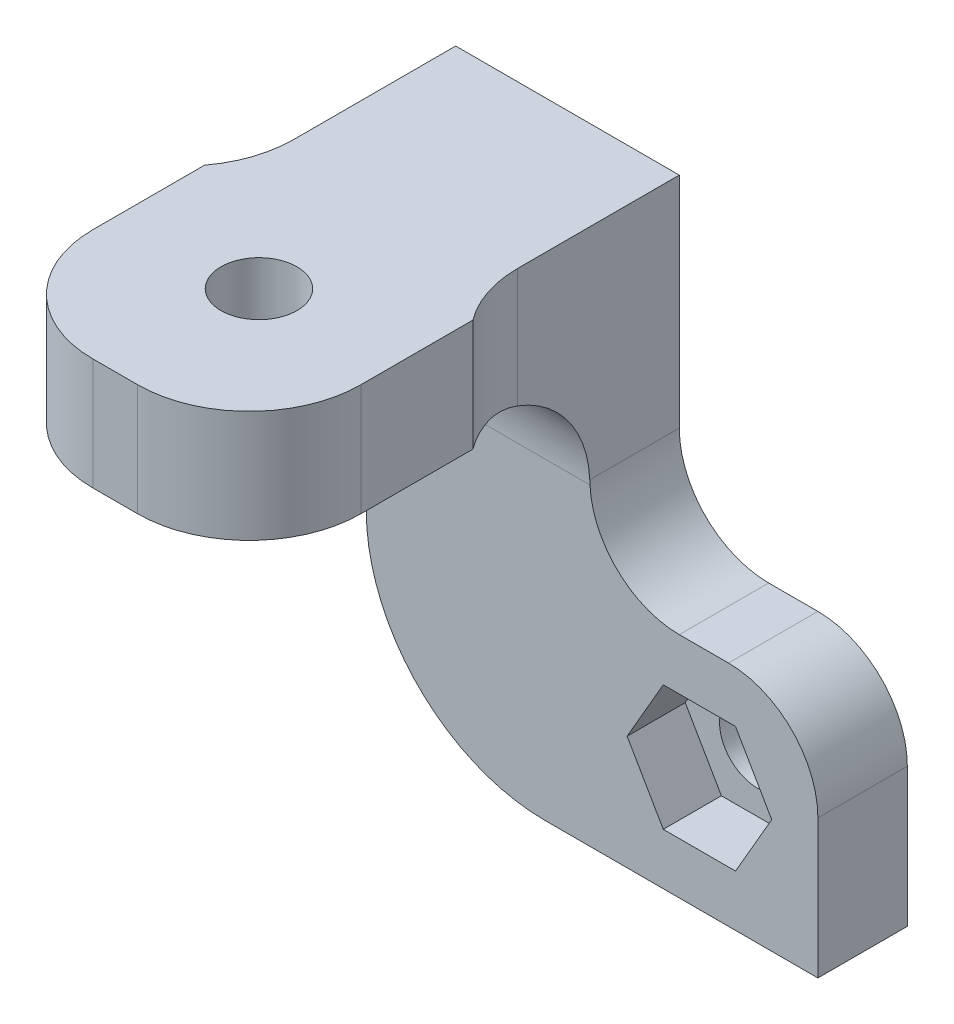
ISO-10303-21;
HEADER;
FILE_DESCRIPTION(('STEP AP214'),'2;1');
FILE_NAME('part.step','',(''),(''),'','','');
FILE_SCHEMA(('AUTOMOTIVE_DESIGN { 1 0 10303 214 1 1 1 1 }'));
ENDSEC;
DATA;
#1=APPLICATION_CONTEXT('core data for automotive mechanical design processes');
#2=APPLICATION_PROTOCOL_DEFINITION('international standard','automotive_design',2000,#1);
#3=PRODUCT_CONTEXT('',#1,'mechanical');
#4=PRODUCT('Part','Part','',(#3));
#5=PRODUCT_RELATED_PRODUCT_CATEGORY('part','',(#4));
#6=PRODUCT_DEFINITION_FORMATION('','',#4);
#7=PRODUCT_DEFINITION_CONTEXT('part definition',#1,'design');
#8=PRODUCT_DEFINITION('design','',#6,#7);
#9=PRODUCT_DEFINITION_SHAPE('','',#8);
#10=(LENGTH_UNIT() NAMED_UNIT(*) SI_UNIT(.MILLI.,.METRE.));
#11=(NAMED_UNIT(*) PLANE_ANGLE_UNIT() SI_UNIT($,.RADIAN.));
#12=(NAMED_UNIT(*) SI_UNIT($,.STERADIAN.) SOLID_ANGLE_UNIT());
#13=UNCERTAINTY_MEASURE_WITH_UNIT(LENGTH_MEASURE(1.E-05),#10,'distance_accuracy_value','');
#14=(GEOMETRIC_REPRESENTATION_CONTEXT(3) GLOBAL_UNCERTAINTY_ASSIGNED_CONTEXT((#13)) GLOBAL_UNIT_ASSIGNED_CONTEXT((#10,
#11,#12)) REPRESENTATION_CONTEXT('',''));
#15=CARTESIAN_POINT('',(0.,0.,0.));
#16=DIRECTION('',(0.,0.,1.));
#17=DIRECTION('',(1.,0.,0.));
#18=AXIS2_PLACEMENT_3D('',#15,#16,#17);
#19=CARTESIAN_POINT('',(3.4185185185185,-12.6654320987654,4.));
#20=DIRECTION('',(0.,0.,-1.));
#21=DIRECTION('',(-1.,0.,0.));
#22=AXIS2_PLACEMENT_3D('',#19,#20,#21);
#23=CYLINDRICAL_SURFACE('',#22,1.7);
#24=CARTESIAN_POINT('',(3.4185185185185,-12.6654320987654,0.));
#25=DIRECTION('',(0.,0.,1.));
#26=DIRECTION('',(1.,0.,0.));
#27=AXIS2_PLACEMENT_3D('',#24,#25,#26);
#28=CIRCLE('',#27,1.7);
#29=CARTESIAN_POINT('',(5.1185185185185,-12.6654320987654,0.));
#30=VERTEX_POINT('',#29);
#31=EDGE_CURVE('E502',#30,#30,#28,.T.);
#32=ORIENTED_EDGE('',*,*,#31,.F.);
#33=EDGE_LOOP('',(#32));
#34=FACE_BOUND('',#33,.T.);
#35=CARTESIAN_POINT('',(3.4185185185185,-12.6654320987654,1.4));
#36=DIRECTION('',(0.,0.,1.));
#37=DIRECTION('',(1.,0.,0.));
#38=AXIS2_PLACEMENT_3D('',#35,#36,#37);
#39=CIRCLE('',#38,1.7);
#40=CARTESIAN_POINT('',(5.1185185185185,-12.6654320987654,1.4));
#41=VERTEX_POINT('',#40);
#42=EDGE_CURVE('E491',#41,#41,#39,.T.);
#43=ORIENTED_EDGE('',*,*,#42,.T.);
#44=EDGE_LOOP('',(#43));
#45=FACE_BOUND('',#44,.T.);
#46=ADVANCED_FACE('F34',(#34,#45),#23,.F.);
#47=CARTESIAN_POINT('',(-11.4814814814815,6.23456790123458,4.));
#48=DIRECTION('',(1.,0.,0.));
#49=DIRECTION('',(0.,1.,0.));
#50=AXIS2_PLACEMENT_3D('',#47,#48,#49);
#51=PLANE('',#50);
#52=CARTESIAN_POINT('',(-11.4814814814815,-3.76543209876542,9.));
#53=DIRECTION('',(1.,0.,0.));
#54=DIRECTION('',(0.,1.,0.));
#55=AXIS2_PLACEMENT_3D('',#52,#53,#54);
#56=CIRCLE('',#55,5.);
#57=CARTESIAN_POINT('',(-11.4814814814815,-3.76543209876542,4.));
#58=VERTEX_POINT('',#57);
#59=CARTESIAN_POINT('',(-11.4814814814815,0.911990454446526,7.23316150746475));
#60=VERTEX_POINT('',#59);
#61=EDGE_CURVE('E438',#58,#60,#56,.T.);
#62=ORIENTED_EDGE('',*,*,#61,.T.);
#63=DIRECTION('',(0.,1.,0.));
#64=VECTOR('',#63,1.);
#65=CARTESIAN_POINT('',(-11.4814814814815,6.23456790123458,7.23316150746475));
#66=LINE('',#65,#64);
#67=CARTESIAN_POINT('',(-11.4814814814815,6.23456790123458,7.23316150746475));
#68=VERTEX_POINT('',#67);
#69=EDGE_CURVE('E294',#60,#68,#66,.T.);
#70=ORIENTED_EDGE('',*,*,#69,.T.);
#71=DIRECTION('',(0.,0.,-1.));
#72=VECTOR('',#71,1.);
#73=CARTESIAN_POINT('',(-11.4814814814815,6.23456790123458,4.));
#74=LINE('',#73,#72);
#75=CARTESIAN_POINT('',(-11.4814814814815,6.23456790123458,0.));
#76=VERTEX_POINT('',#75);
#77=EDGE_CURVE('E396',#68,#76,#74,.T.);
#78=ORIENTED_EDGE('',*,*,#77,.T.);
#79=DIRECTION('',(0.,-1.,0.));
#80=VECTOR('',#79,1.);
#81=CARTESIAN_POINT('',(-11.4814814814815,6.23456790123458,0.));
#82=LINE('',#81,#80);
#83=CARTESIAN_POINT('',(-11.4814814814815,-9.76543209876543,0.));
#84=VERTEX_POINT('',#83);
#85=EDGE_CURVE('E559',#76,#84,#82,.T.);
#86=ORIENTED_EDGE('',*,*,#85,.T.);
#87=DIRECTION('',(0.,0.,-1.));
#88=VECTOR('',#87,1.);
#89=CARTESIAN_POINT('',(-11.4814814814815,-9.76543209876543,4.));
#90=LINE('',#89,#88);
#91=CARTESIAN_POINT('',(-11.4814814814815,-9.76543209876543,4.));
#92=VERTEX_POINT('',#91);
#93=EDGE_CURVE('E404',#84,#92,#90,.F.);
#94=ORIENTED_EDGE('',*,*,#93,.T.);
#95=DIRECTION('',(0.,-1.,0.));
#96=VECTOR('',#95,1.);
#97=CARTESIAN_POINT('',(-11.4814814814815,6.23456790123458,4.));
#98=LINE('',#97,#96);
#99=EDGE_CURVE('E397',#58,#92,#98,.T.);
#100=ORIENTED_EDGE('',*,*,#99,.F.);
#101=EDGE_LOOP('',(#62,#70,#78,#86,#94,#100));
#102=FACE_BOUND('',#101,.T.);
#103=ADVANCED_FACE('F276',(#102),#51,.F.);
#104=CARTESIAN_POINT('',(-11.4814814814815,-17.7654320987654,4.));
#105=DIRECTION('',(0.,1.,0.));
#106=DIRECTION('',(0.,0.,1.));
#107=AXIS2_PLACEMENT_3D('',#104,#105,#106);
#108=PLANE('',#107);
#109=DIRECTION('',(1.,0.,0.));
#110=VECTOR('',#109,1.);
#111=CARTESIAN_POINT('',(-11.4814814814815,-17.7654320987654,4.));
#112=LINE('',#111,#110);
#113=CARTESIAN_POINT('',(-3.4814814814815,-17.7654320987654,4.));
#114=VERTEX_POINT('',#113);
#115=CARTESIAN_POINT('',(8.71851851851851,-17.7654320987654,4.));
#116=VERTEX_POINT('',#115);
#117=EDGE_CURVE('E387',#114,#116,#112,.T.);
#118=ORIENTED_EDGE('',*,*,#117,.F.);
#119=DIRECTION('',(0.,0.,-1.));
#120=VECTOR('',#119,1.);
#121=CARTESIAN_POINT('',(-3.4814814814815,-17.7654320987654,4.));
#122=LINE('',#121,#120);
#123=CARTESIAN_POINT('',(-3.4814814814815,-17.7654320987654,0.));
#124=VERTEX_POINT('',#123);
#125=EDGE_CURVE('E389',#114,#124,#122,.T.);
#126=ORIENTED_EDGE('',*,*,#125,.T.);
#127=DIRECTION('',(1.,0.,0.));
#128=VECTOR('',#127,1.);
#129=CARTESIAN_POINT('',(-11.4814814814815,-17.7654320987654,0.));
#130=LINE('',#129,#128);
#131=CARTESIAN_POINT('',(8.71851851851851,-17.7654320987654,0.));
#132=VERTEX_POINT('',#131);
#133=EDGE_CURVE('E573',#124,#132,#130,.T.);
#134=ORIENTED_EDGE('',*,*,#133,.T.);
#135=DIRECTION('',(0.,0.,-1.));
#136=VECTOR('',#135,1.);
#137=CARTESIAN_POINT('',(8.71851851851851,-17.7654320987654,4.));
#138=LINE('',#137,#136);
#139=EDGE_CURVE('E392',#116,#132,#138,.T.);
#140=ORIENTED_EDGE('',*,*,#139,.F.);
#141=EDGE_LOOP('',(#118,#126,#134,#140));
#142=FACE_BOUND('',#141,.T.);
#143=ADVANCED_FACE('F318',(#142),#108,.F.);
#144=CARTESIAN_POINT('',(-1.4814814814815,6.23456790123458,4.));
#145=DIRECTION('',(-1.,0.,0.));
#146=DIRECTION('',(0.,-1.,0.));
#147=AXIS2_PLACEMENT_3D('',#144,#145,#146);
#148=PLANE('',#147);
#149=DIRECTION('',(0.,0.,-1.));
#150=VECTOR('',#149,1.);
#151=CARTESIAN_POINT('',(-1.4814814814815,6.23456790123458,4.));
#152=LINE('',#151,#150);
#153=CARTESIAN_POINT('',(-1.4814814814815,6.23456790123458,7.2331615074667));
#154=VERTEX_POINT('',#153);
#155=CARTESIAN_POINT('',(-1.4814814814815,6.23456790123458,0.));
#156=VERTEX_POINT('',#155);
#157=EDGE_CURVE('E444',#154,#156,#152,.T.);
#158=ORIENTED_EDGE('',*,*,#157,.F.);
#159=DIRECTION('',(0.,-1.,0.));
#160=VECTOR('',#159,1.);
#161=CARTESIAN_POINT('',(-1.4814814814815,6.23456790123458,7.2331615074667));
#162=LINE('',#161,#160);
#163=CARTESIAN_POINT('',(-1.4814814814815,0.91199045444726,7.2331615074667));
#164=VERTEX_POINT('',#163);
#165=EDGE_CURVE('E257',#154,#164,#162,.T.);
#166=ORIENTED_EDGE('',*,*,#165,.T.);
#167=CARTESIAN_POINT('',(-1.4814814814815,-3.76543209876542,9.));
#168=DIRECTION('',(-1.,0.,0.));
#169=DIRECTION('',(0.,-1.,0.));
#170=AXIS2_PLACEMENT_3D('',#167,#168,#169);
#171=CIRCLE('',#170,5.);
#172=CARTESIAN_POINT('',(-1.4814814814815,-3.56543209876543,4.00400160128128));
#173=VERTEX_POINT('',#172);
#174=EDGE_CURVE('E585',#164,#173,#171,.T.);
#175=ORIENTED_EDGE('',*,*,#174,.T.);
#176=DIRECTION('',(0.,0.,-1.));
#177=VECTOR('',#176,1.);
#178=CARTESIAN_POINT('',(-1.4814814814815,-3.56543209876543,0.));
#179=LINE('',#178,#177);
#180=CARTESIAN_POINT('',(-1.4814814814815,-3.56543209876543,0.));
#181=VERTEX_POINT('',#180);
#182=EDGE_CURVE('E601',#173,#181,#179,.T.);
#183=ORIENTED_EDGE('',*,*,#182,.T.);
#184=DIRECTION('',(0.,1.,0.));
#185=VECTOR('',#184,1.);
#186=CARTESIAN_POINT('',(-1.4814814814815,6.23456790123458,0.));
#187=LINE('',#186,#185);
#188=EDGE_CURVE('E575',#181,#156,#187,.T.);
#189=ORIENTED_EDGE('',*,*,#188,.T.);
#190=EDGE_LOOP('',(#158,#166,#175,#183,#189));
#191=FACE_BOUND('',#190,.T.);
#192=ADVANCED_FACE('F377',(#191),#148,.F.);
#193=CARTESIAN_POINT('',(-11.4814814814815,6.23456790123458,4.));
#194=DIRECTION('',(0.,-1.,0.));
#195=DIRECTION('',(0.,0.,-1.));
#196=AXIS2_PLACEMENT_3D('',#193,#194,#195);
#197=PLANE('',#196);
#198=DIRECTION('',(-1.,0.,0.));
#199=VECTOR('',#198,1.);
#200=CARTESIAN_POINT('',(-12.4814814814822,6.23456790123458,20.2331615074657));
#201=LINE('',#200,#199);
#202=CARTESIAN_POINT('',(-5.48148148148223,6.23456790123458,20.2331615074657));
#203=VERTEX_POINT('',#202);
#204=CARTESIAN_POINT('',(-7.48148148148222,6.23456790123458,20.2331615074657));
#205=VERTEX_POINT('',#204);
#206=EDGE_CURVE('E251',#203,#205,#201,.T.);
#207=ORIENTED_EDGE('',*,*,#206,.F.);
#208=CARTESIAN_POINT('',(-5.48148148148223,6.23456790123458,15.2331615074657));
#209=DIRECTION('',(0.,-1.,0.));
#210=DIRECTION('',(0.,0.,-1.));
#211=AXIS2_PLACEMENT_3D('',#208,#209,#210);
#212=CIRCLE('',#211,5.);
#213=CARTESIAN_POINT('',(-0.481481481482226,6.23456790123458,15.2331615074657));
#214=VERTEX_POINT('',#213);
#215=EDGE_CURVE('E250',#203,#214,#212,.F.);
#216=ORIENTED_EDGE('',*,*,#215,.T.);
#217=DIRECTION('',(0.,0.,1.));
#218=VECTOR('',#217,1.);
#219=CARTESIAN_POINT('',(-0.481481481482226,6.23456790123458,20.2331615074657));
#220=LINE('',#219,#218);
#221=CARTESIAN_POINT('',(-0.481481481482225,6.23456790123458,10.2331615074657));
#222=VERTEX_POINT('',#221);
#223=EDGE_CURVE('E233',#222,#214,#220,.T.);
#224=ORIENTED_EDGE('',*,*,#223,.F.);
#225=CARTESIAN_POINT('',(3.5185185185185,6.23456790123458,7.2331615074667));
#226=DIRECTION('',(0.,-1.,0.));
#227=DIRECTION('',(0.,0.,-1.));
#228=AXIS2_PLACEMENT_3D('',#225,#226,#227);
#229=CIRCLE('',#228,5.);
#230=EDGE_CURVE('E247',#222,#154,#229,.T.);
#231=ORIENTED_EDGE('',*,*,#230,.T.);
#232=ORIENTED_EDGE('',*,*,#157,.T.);
#233=DIRECTION('',(-1.,0.,0.));
#234=VECTOR('',#233,1.);
#235=CARTESIAN_POINT('',(-11.4814814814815,6.23456790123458,0.));
#236=LINE('',#235,#234);
#237=EDGE_CURVE('E442',#156,#76,#236,.T.);
#238=ORIENTED_EDGE('',*,*,#237,.T.);
#239=ORIENTED_EDGE('',*,*,#77,.F.);
#240=CARTESIAN_POINT('',(-16.4814814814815,6.23456790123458,7.23316150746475));
#241=DIRECTION('',(0.,-1.,0.));
#242=DIRECTION('',(0.,0.,-1.));
#243=AXIS2_PLACEMENT_3D('',#240,#241,#242);
#244=CIRCLE('',#243,5.);
#245=CARTESIAN_POINT('',(-12.4814814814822,6.23456790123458,10.2331615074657));
#246=VERTEX_POINT('',#245);
#247=EDGE_CURVE('E11',#68,#246,#244,.T.);
#248=ORIENTED_EDGE('',*,*,#247,.T.);
#249=DIRECTION('',(0.,0.,-1.));
#250=VECTOR('',#249,1.);
#251=CARTESIAN_POINT('',(-12.4814814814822,6.23456790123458,20.2331615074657));
#252=LINE('',#251,#250);
#253=CARTESIAN_POINT('',(-12.4814814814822,6.23456790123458,15.2331615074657));
#254=VERTEX_POINT('',#253);
#255=EDGE_CURVE('E241',#254,#246,#252,.T.);
#256=ORIENTED_EDGE('',*,*,#255,.F.);
#257=CARTESIAN_POINT('',(-7.48148148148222,6.23456790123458,15.2331615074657));
#258=DIRECTION('',(0.,-1.,0.));
#259=DIRECTION('',(0.,0.,-1.));
#260=AXIS2_PLACEMENT_3D('',#257,#258,#259);
#261=CIRCLE('',#260,5.);
#262=EDGE_CURVE('E423',#254,#205,#261,.F.);
#263=ORIENTED_EDGE('',*,*,#262,.T.);
#264=EDGE_LOOP('',(#207,#216,#224,#231,#232,#238,#239,#248,#256,#263));
#265=FACE_BOUND('',#264,.T.);
#266=CARTESIAN_POINT('',(-6.4814814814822,6.23456790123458,13.8000000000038));
#267=DIRECTION('',(0.,-1.,0.));
#268=DIRECTION('',(0.,0.,-1.));
#269=AXIS2_PLACEMENT_3D('',#266,#267,#268);
#270=CIRCLE('',#269,1.70000000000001);
#271=CARTESIAN_POINT('',(-6.4814814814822,6.23456790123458,12.1000000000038));
#272=VERTEX_POINT('',#271);
#273=EDGE_CURVE('E518',#272,#272,#270,.T.);
#274=ORIENTED_EDGE('',*,*,#273,.T.);
#275=EDGE_LOOP('',(#274));
#276=FACE_BOUND('',#275,.T.);
#277=ADVANCED_FACE('F245',(#265,#276),#197,.F.);
#278=CARTESIAN_POINT('',(0.,0.,4.));
#279=DIRECTION('',(0.,0.,1.));
#280=DIRECTION('',(1.,0.,0.));
#281=AXIS2_PLACEMENT_3D('',#278,#279,#280);
#282=PLANE('',#281);
#283=DIRECTION('',(-0.5,0.866025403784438,0.));
#284=VECTOR('',#283,1.);
#285=CARTESIAN_POINT('',(6.6516800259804,-12.6654320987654,4.));
#286=LINE('',#285,#284);
#287=CARTESIAN_POINT('',(6.6516800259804,-12.6654320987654,4.));
#288=VERTEX_POINT('',#287);
#289=CARTESIAN_POINT('',(5.03509927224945,-9.86543209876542,4.));
#290=VERTEX_POINT('',#289);
#291=EDGE_CURVE('E449',#288,#290,#286,.T.);
#292=ORIENTED_EDGE('',*,*,#291,.F.);
#293=DIRECTION('',(0.5,0.866025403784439,0.));
#294=VECTOR('',#293,1.);
#295=CARTESIAN_POINT('',(5.03509927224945,-15.4654320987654,4.));
#296=LINE('',#295,#294);
#297=CARTESIAN_POINT('',(5.03509927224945,-15.4654320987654,4.));
#298=VERTEX_POINT('',#297);
#299=EDGE_CURVE('E460',#298,#288,#296,.T.);
#300=ORIENTED_EDGE('',*,*,#299,.F.);
#301=DIRECTION('',(1.,0.,0.));
#302=VECTOR('',#301,1.);
#303=CARTESIAN_POINT('',(1.80193776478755,-15.4654320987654,4.));
#304=LINE('',#303,#302);
#305=CARTESIAN_POINT('',(1.80193776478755,-15.4654320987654,4.));
#306=VERTEX_POINT('',#305);
#307=EDGE_CURVE('E484',#306,#298,#304,.T.);
#308=ORIENTED_EDGE('',*,*,#307,.F.);
#309=DIRECTION('',(0.5,-0.866025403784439,0.));
#310=VECTOR('',#309,1.);
#311=CARTESIAN_POINT('',(0.1853570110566,-12.6654320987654,4.));
#312=LINE('',#311,#310);
#313=CARTESIAN_POINT('',(0.1853570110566,-12.6654320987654,4.));
#314=VERTEX_POINT('',#313);
#315=EDGE_CURVE('E481',#314,#306,#312,.T.);
#316=ORIENTED_EDGE('',*,*,#315,.F.);
#317=DIRECTION('',(-0.5,-0.866025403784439,0.));
#318=VECTOR('',#317,1.);
#319=CARTESIAN_POINT('',(1.80193776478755,-9.86543209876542,4.));
#320=LINE('',#319,#318);
#321=CARTESIAN_POINT('',(1.80193776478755,-9.86543209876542,4.));
#322=VERTEX_POINT('',#321);
#323=EDGE_CURVE('E478',#322,#314,#320,.T.);
#324=ORIENTED_EDGE('',*,*,#323,.F.);
#325=DIRECTION('',(-1.,0.,0.));
#326=VECTOR('',#325,1.);
#327=CARTESIAN_POINT('',(5.03509927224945,-9.86543209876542,4.));
#328=LINE('',#327,#326);
#329=EDGE_CURVE('E451',#290,#322,#328,.T.);
#330=ORIENTED_EDGE('',*,*,#329,.F.);
#331=EDGE_LOOP('',(#292,#300,#308,#316,#324,#330));
#332=FACE_BOUND('',#331,.T.);
#333=ORIENTED_EDGE('',*,*,#99,.T.);
#334=CARTESIAN_POINT('',(-3.4814814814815,-9.76543209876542,4.));
#335=DIRECTION('',(0.,0.,1.));
#336=DIRECTION('',(1.,0.,0.));
#337=AXIS2_PLACEMENT_3D('',#334,#335,#336);
#338=CIRCLE('',#337,8.);
#339=EDGE_CURVE('E402',#92,#114,#338,.T.);
#340=ORIENTED_EDGE('',*,*,#339,.T.);
#341=ORIENTED_EDGE('',*,*,#117,.T.);
#342=DIRECTION('',(0.,1.,0.));
#343=VECTOR('',#342,1.);
#344=CARTESIAN_POINT('',(8.71851851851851,-17.7654320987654,4.));
#345=LINE('',#344,#343);
#346=CARTESIAN_POINT('',(8.71851851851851,-11.5654320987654,4.));
#347=VERTEX_POINT('',#346);
#348=EDGE_CURVE('E506',#116,#347,#345,.T.);
#349=ORIENTED_EDGE('',*,*,#348,.T.);
#350=CARTESIAN_POINT('',(4.71851851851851,-11.5654320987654,4.));
#351=DIRECTION('',(0.,0.,1.));
#352=DIRECTION('',(1.,0.,0.));
#353=AXIS2_PLACEMENT_3D('',#350,#351,#352);
#354=CIRCLE('',#353,4.);
#355=CARTESIAN_POINT('',(4.71851851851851,-7.56543209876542,4.));
#356=VERTEX_POINT('',#355);
#357=EDGE_CURVE('E599',#347,#356,#354,.T.);
#358=ORIENTED_EDGE('',*,*,#357,.T.);
#359=DIRECTION('',(-1.,0.,0.));
#360=VECTOR('',#359,1.);
#361=CARTESIAN_POINT('',(8.71851851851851,-7.56543209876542,4.));
#362=LINE('',#361,#360);
#363=CARTESIAN_POINT('',(2.5185185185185,-7.56543209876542,4.));
#364=VERTEX_POINT('',#363);
#365=EDGE_CURVE('E508',#356,#364,#362,.T.);
#366=ORIENTED_EDGE('',*,*,#365,.T.);
#367=CARTESIAN_POINT('',(2.5185185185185,-3.56543209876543,4.));
#368=DIRECTION('',(0.,0.,1.));
#369=DIRECTION('',(1.,0.,0.));
#370=AXIS2_PLACEMENT_3D('',#367,#368,#369);
#371=CIRCLE('',#370,4.);
#372=CARTESIAN_POINT('',(-1.47647835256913,-3.76543209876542,4.));
#373=VERTEX_POINT('',#372);
#374=EDGE_CURVE('E407',#364,#373,#371,.F.);
#375=ORIENTED_EDGE('',*,*,#374,.T.);
#376=DIRECTION('',(1.,0.,0.));
#377=VECTOR('',#376,1.);
#378=CARTESIAN_POINT('',(0.,-3.76543209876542,4.));
#379=LINE('',#378,#377);
#380=EDGE_CURVE('E583',#373,#58,#379,.F.);
#381=ORIENTED_EDGE('',*,*,#380,.T.);
#382=EDGE_LOOP('',(#333,#340,#341,#349,#358,#366,#375,#381));
#383=FACE_BOUND('',#382,.T.);
#384=ADVANCED_FACE('F368',(#332,#383),#282,.T.);
#385=CARTESIAN_POINT('',(0.,0.,0.));
#386=DIRECTION('',(0.,0.,1.));
#387=DIRECTION('',(1.,0.,0.));
#388=AXIS2_PLACEMENT_3D('',#385,#386,#387);
#389=PLANE('',#388);
#390=ORIENTED_EDGE('',*,*,#133,.F.);
#391=CARTESIAN_POINT('',(-3.4814814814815,-9.76543209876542,0.));
#392=DIRECTION('',(0.,0.,1.));
#393=DIRECTION('',(1.,0.,0.));
#394=AXIS2_PLACEMENT_3D('',#391,#392,#393);
#395=CIRCLE('',#394,8.);
#396=EDGE_CURVE('E403',#124,#84,#395,.F.);
#397=ORIENTED_EDGE('',*,*,#396,.T.);
#398=ORIENTED_EDGE('',*,*,#85,.F.);
#399=ORIENTED_EDGE('',*,*,#237,.F.);
#400=ORIENTED_EDGE('',*,*,#188,.F.);
#401=CARTESIAN_POINT('',(2.5185185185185,-3.56543209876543,0.));
#402=DIRECTION('',(0.,0.,1.));
#403=DIRECTION('',(1.,0.,0.));
#404=AXIS2_PLACEMENT_3D('',#401,#402,#403);
#405=CIRCLE('',#404,4.);
#406=CARTESIAN_POINT('',(2.5185185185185,-7.56543209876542,0.));
#407=VERTEX_POINT('',#406);
#408=EDGE_CURVE('E604',#181,#407,#405,.T.);
#409=ORIENTED_EDGE('',*,*,#408,.T.);
#410=DIRECTION('',(-1.,0.,0.));
#411=VECTOR('',#410,1.);
#412=CARTESIAN_POINT('',(8.71851851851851,-7.56543209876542,0.));
#413=LINE('',#412,#411);
#414=CARTESIAN_POINT('',(4.71851851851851,-7.56543209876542,0.));
#415=VERTEX_POINT('',#414);
#416=EDGE_CURVE('E509',#415,#407,#413,.T.);
#417=ORIENTED_EDGE('',*,*,#416,.F.);
#418=CARTESIAN_POINT('',(4.71851851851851,-11.5654320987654,0.));
#419=DIRECTION('',(0.,0.,1.));
#420=DIRECTION('',(1.,0.,0.));
#421=AXIS2_PLACEMENT_3D('',#418,#419,#420);
#422=CIRCLE('',#421,4.);
#423=CARTESIAN_POINT('',(8.71851851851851,-11.5654320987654,0.));
#424=VERTEX_POINT('',#423);
#425=EDGE_CURVE('E595',#415,#424,#422,.F.);
#426=ORIENTED_EDGE('',*,*,#425,.T.);
#427=DIRECTION('',(0.,1.,0.));
#428=VECTOR('',#427,1.);
#429=CARTESIAN_POINT('',(8.71851851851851,-17.7654320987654,0.));
#430=LINE('',#429,#428);
#431=EDGE_CURVE('E505',#132,#424,#430,.T.);
#432=ORIENTED_EDGE('',*,*,#431,.F.);
#433=EDGE_LOOP('',(#390,#397,#398,#399,#400,#409,#417,#426,#432));
#434=FACE_BOUND('',#433,.T.);
#435=ORIENTED_EDGE('',*,*,#31,.T.);
#436=EDGE_LOOP('',(#435));
#437=FACE_BOUND('',#436,.T.);
#438=ADVANCED_FACE('F367',(#434,#437),#389,.F.);
#439=CARTESIAN_POINT('',(-11.4814814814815,1.23456790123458,19.4));
#440=DIRECTION('',(0.,1.,0.));
#441=DIRECTION('',(0.,0.,1.));
#442=AXIS2_PLACEMENT_3D('',#439,#440,#441);
#443=PLANE('',#442);
#444=DIRECTION('',(0.,0.,1.));
#445=VECTOR('',#444,1.);
#446=CARTESIAN_POINT('',(-0.481481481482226,1.23456790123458,20.2331615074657));
#447=LINE('',#446,#445);
#448=CARTESIAN_POINT('',(-0.481481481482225,1.23456790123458,10.2331615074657));
#449=VERTEX_POINT('',#448);
#450=CARTESIAN_POINT('',(-0.481481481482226,1.23456790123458,15.2331615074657));
#451=VERTEX_POINT('',#450);
#452=EDGE_CURVE('E236',#449,#451,#447,.T.);
#453=ORIENTED_EDGE('',*,*,#452,.T.);
#454=CARTESIAN_POINT('',(-5.48148148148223,1.23456790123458,15.2331615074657));
#455=DIRECTION('',(0.,1.,0.));
#456=DIRECTION('',(0.,0.,1.));
#457=AXIS2_PLACEMENT_3D('',#454,#455,#456);
#458=CIRCLE('',#457,5.);
#459=CARTESIAN_POINT('',(-5.48148148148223,1.23456790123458,20.2331615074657));
#460=VERTEX_POINT('',#459);
#461=EDGE_CURVE('E416',#451,#460,#458,.F.);
#462=ORIENTED_EDGE('',*,*,#461,.T.);
#463=DIRECTION('',(-1.,0.,0.));
#464=VECTOR('',#463,1.);
#465=CARTESIAN_POINT('',(-12.4814814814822,1.23456790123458,20.2331615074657));
#466=LINE('',#465,#464);
#467=CARTESIAN_POINT('',(-7.48148148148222,1.23456790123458,20.2331615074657));
#468=VERTEX_POINT('',#467);
#469=EDGE_CURVE('E836',#460,#468,#466,.T.);
#470=ORIENTED_EDGE('',*,*,#469,.T.);
#471=CARTESIAN_POINT('',(-7.48148148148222,1.23456790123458,15.2331615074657));
#472=DIRECTION('',(0.,1.,0.));
#473=DIRECTION('',(0.,0.,1.));
#474=AXIS2_PLACEMENT_3D('',#471,#472,#473);
#475=CIRCLE('',#474,5.);
#476=CARTESIAN_POINT('',(-12.4814814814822,1.23456790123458,15.2331615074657));
#477=VERTEX_POINT('',#476);
#478=EDGE_CURVE('E414',#468,#477,#475,.F.);
#479=ORIENTED_EDGE('',*,*,#478,.T.);
#480=DIRECTION('',(0.,0.,-1.));
#481=VECTOR('',#480,1.);
#482=CARTESIAN_POINT('',(-12.4814814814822,1.23456790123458,20.2331615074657));
#483=LINE('',#482,#481);
#484=CARTESIAN_POINT('',(-12.4814814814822,1.23456790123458,10.2331615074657));
#485=VERTEX_POINT('',#484);
#486=EDGE_CURVE('E252',#477,#485,#483,.T.);
#487=ORIENTED_EDGE('',*,*,#486,.T.);
#488=CARTESIAN_POINT('',(-16.4814814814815,1.23456790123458,7.23316150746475));
#489=DIRECTION('',(0.,1.,0.));
#490=DIRECTION('',(0.,0.,1.));
#491=AXIS2_PLACEMENT_3D('',#488,#489,#490);
#492=CIRCLE('',#491,5.);
#493=CARTESIAN_POINT('',(-11.8040589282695,1.23456790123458,9.));
#494=VERTEX_POINT('',#493);
#495=EDGE_CURVE('E258',#485,#494,#492,.T.);
#496=ORIENTED_EDGE('',*,*,#495,.T.);
#497=DIRECTION('',(1.,0.,0.));
#498=VECTOR('',#497,1.);
#499=CARTESIAN_POINT('',(-11.4814814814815,1.23456790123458,9.));
#500=LINE('',#499,#498);
#501=CARTESIAN_POINT('',(-1.15890403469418,1.23456790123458,9.));
#502=VERTEX_POINT('',#501);
#503=EDGE_CURVE('E50',#494,#502,#500,.T.);
#504=ORIENTED_EDGE('',*,*,#503,.T.);
#505=CARTESIAN_POINT('',(3.5185185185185,1.23456790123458,7.2331615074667));
#506=DIRECTION('',(0.,1.,0.));
#507=DIRECTION('',(0.,0.,1.));
#508=AXIS2_PLACEMENT_3D('',#505,#506,#507);
#509=CIRCLE('',#508,5.);
#510=EDGE_CURVE('E259',#502,#449,#509,.T.);
#511=ORIENTED_EDGE('',*,*,#510,.T.);
#512=EDGE_LOOP('',(#453,#462,#470,#479,#487,#496,#504,#511));
#513=FACE_BOUND('',#512,.T.);
#514=DIRECTION('',(0.866025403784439,0.,0.5));
#515=VECTOR('',#514,1.);
#516=CARTESIAN_POINT('',(-6.48148148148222,1.23456790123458,10.5668384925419));
#517=LINE('',#516,#515);
#518=CARTESIAN_POINT('',(-6.48148148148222,1.23456790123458,10.5668384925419));
#519=VERTEX_POINT('',#518);
#520=CARTESIAN_POINT('',(-3.68148148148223,1.23456790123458,12.1834192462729));
#521=VERTEX_POINT('',#520);
#522=EDGE_CURVE('E543',#519,#521,#517,.T.);
#523=ORIENTED_EDGE('',*,*,#522,.F.);
#524=DIRECTION('',(0.866025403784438,0.,-0.5));
#525=VECTOR('',#524,1.);
#526=CARTESIAN_POINT('',(-9.28148148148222,1.23456790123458,12.1834192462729));
#527=LINE('',#526,#525);
#528=CARTESIAN_POINT('',(-9.28148148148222,1.23456790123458,12.1834192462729));
#529=VERTEX_POINT('',#528);
#530=EDGE_CURVE('E521',#529,#519,#527,.T.);
#531=ORIENTED_EDGE('',*,*,#530,.F.);
#532=DIRECTION('',(0.,0.,-1.));
#533=VECTOR('',#532,1.);
#534=CARTESIAN_POINT('',(-9.28148148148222,1.23456790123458,15.4165807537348));
#535=LINE('',#534,#533);
#536=CARTESIAN_POINT('',(-9.28148148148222,1.23456790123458,15.4165807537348));
#537=VERTEX_POINT('',#536);
#538=EDGE_CURVE('E526',#537,#529,#535,.T.);
#539=ORIENTED_EDGE('',*,*,#538,.F.);
#540=DIRECTION('',(-0.866025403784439,0.,-0.5));
#541=VECTOR('',#540,1.);
#542=CARTESIAN_POINT('',(-6.48148148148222,1.23456790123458,17.0331615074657));
#543=LINE('',#542,#541);
#544=CARTESIAN_POINT('',(-6.48148148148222,1.23456790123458,17.0331615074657));
#545=VERTEX_POINT('',#544);
#546=EDGE_CURVE('E552',#545,#537,#543,.T.);
#547=ORIENTED_EDGE('',*,*,#546,.F.);
#548=DIRECTION('',(-0.866025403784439,0.,0.499999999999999));
#549=VECTOR('',#548,1.);
#550=CARTESIAN_POINT('',(-3.68148148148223,1.23456790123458,15.4165807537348));
#551=LINE('',#550,#549);
#552=CARTESIAN_POINT('',(-3.68148148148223,1.23456790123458,15.4165807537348));
#553=VERTEX_POINT('',#552);
#554=EDGE_CURVE('E549',#553,#545,#551,.T.);
#555=ORIENTED_EDGE('',*,*,#554,.F.);
#556=DIRECTION('',(0.,0.,1.));
#557=VECTOR('',#556,1.);
#558=CARTESIAN_POINT('',(-3.68148148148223,1.23456790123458,12.1834192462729));
#559=LINE('',#558,#557);
#560=EDGE_CURVE('E546',#521,#553,#559,.T.);
#561=ORIENTED_EDGE('',*,*,#560,.F.);
#562=EDGE_LOOP('',(#523,#531,#539,#547,#555,#561));
#563=FACE_BOUND('',#562,.T.);
#564=ADVANCED_FACE('F363',(#513,#563),#443,.F.);
#565=CARTESIAN_POINT('',(-9.28148148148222,3.83456790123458,12.1834192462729));
#566=DIRECTION('',(-0.5,0.,-0.866025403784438));
#567=DIRECTION('',(-0.866025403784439,0.,0.5));
#568=AXIS2_PLACEMENT_3D('',#565,#566,#567);
#569=PLANE('',#568);
#570=ORIENTED_EDGE('',*,*,#530,.T.);
#571=DIRECTION('',(0.,-1.,0.));
#572=VECTOR('',#571,1.);
#573=CARTESIAN_POINT('',(-6.48148148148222,3.83456790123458,10.5668384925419));
#574=LINE('',#573,#572);
#575=CARTESIAN_POINT('',(-6.48148148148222,3.83456790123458,10.5668384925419));
#576=VERTEX_POINT('',#575);
#577=EDGE_CURVE('E541',#576,#519,#574,.T.);
#578=ORIENTED_EDGE('',*,*,#577,.F.);
#579=DIRECTION('',(0.866025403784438,0.,-0.5));
#580=VECTOR('',#579,1.);
#581=CARTESIAN_POINT('',(-9.28148148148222,3.83456790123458,12.1834192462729));
#582=LINE('',#581,#580);
#583=CARTESIAN_POINT('',(-9.28148148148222,3.83456790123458,12.1834192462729));
#584=VERTEX_POINT('',#583);
#585=EDGE_CURVE('E522',#584,#576,#582,.T.);
#586=ORIENTED_EDGE('',*,*,#585,.F.);
#587=DIRECTION('',(0.,-1.,0.));
#588=VECTOR('',#587,1.);
#589=CARTESIAN_POINT('',(-9.28148148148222,3.83456790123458,12.1834192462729));
#590=LINE('',#589,#588);
#591=EDGE_CURVE('E557',#584,#529,#590,.T.);
#592=ORIENTED_EDGE('',*,*,#591,.T.);
#593=EDGE_LOOP('',(#570,#578,#586,#592));
#594=FACE_BOUND('',#593,.T.);
#595=ADVANCED_FACE('F345',(#594),#569,.F.);
#596=CARTESIAN_POINT('',(-9.28148148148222,3.83456790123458,15.4165807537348));
#597=DIRECTION('',(-1.,0.,0.));
#598=DIRECTION('',(0.,0.,1.));
#599=AXIS2_PLACEMENT_3D('',#596,#597,#598);
#600=PLANE('',#599);
#601=ORIENTED_EDGE('',*,*,#538,.T.);
#602=ORIENTED_EDGE('',*,*,#591,.F.);
#603=DIRECTION('',(0.,0.,-1.));
#604=VECTOR('',#603,1.);
#605=CARTESIAN_POINT('',(-9.28148148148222,3.83456790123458,15.4165807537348));
#606=LINE('',#605,#604);
#607=CARTESIAN_POINT('',(-9.28148148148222,3.83456790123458,15.4165807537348));
#608=VERTEX_POINT('',#607);
#609=EDGE_CURVE('E538',#608,#584,#606,.T.);
#610=ORIENTED_EDGE('',*,*,#609,.F.);
#611=DIRECTION('',(0.,-1.,0.));
#612=VECTOR('',#611,1.);
#613=CARTESIAN_POINT('',(-9.28148148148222,3.83456790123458,15.4165807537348));
#614=LINE('',#613,#612);
#615=EDGE_CURVE('E560',#608,#537,#614,.T.);
#616=ORIENTED_EDGE('',*,*,#615,.T.);
#617=EDGE_LOOP('',(#601,#602,#610,#616));
#618=FACE_BOUND('',#617,.T.);
#619=ADVANCED_FACE('F341',(#618),#600,.F.);
#620=CARTESIAN_POINT('',(-6.48148148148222,3.83456790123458,17.0331615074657));
#621=DIRECTION('',(-0.499999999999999,0.,0.866025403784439));
#622=DIRECTION('',(0.866025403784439,0.,0.499999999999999));
#623=AXIS2_PLACEMENT_3D('',#620,#621,#622);
#624=PLANE('',#623);
#625=ORIENTED_EDGE('',*,*,#546,.T.);
#626=ORIENTED_EDGE('',*,*,#615,.F.);
#627=DIRECTION('',(-0.866025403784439,0.,-0.5));
#628=VECTOR('',#627,1.);
#629=CARTESIAN_POINT('',(-6.48148148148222,3.83456790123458,17.0331615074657));
#630=LINE('',#629,#628);
#631=CARTESIAN_POINT('',(-6.48148148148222,3.83456790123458,17.0331615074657));
#632=VERTEX_POINT('',#631);
#633=EDGE_CURVE('E535',#632,#608,#630,.T.);
#634=ORIENTED_EDGE('',*,*,#633,.F.);
#635=DIRECTION('',(0.,-1.,0.));
#636=VECTOR('',#635,1.);
#637=CARTESIAN_POINT('',(-6.48148148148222,3.83456790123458,17.0331615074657));
#638=LINE('',#637,#636);
#639=EDGE_CURVE('E562',#632,#545,#638,.T.);
#640=ORIENTED_EDGE('',*,*,#639,.T.);
#641=EDGE_LOOP('',(#625,#626,#634,#640));
#642=FACE_BOUND('',#641,.T.);
#643=ADVANCED_FACE('F344',(#642),#624,.F.);
#644=CARTESIAN_POINT('',(-3.68148148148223,3.83456790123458,15.4165807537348));
#645=DIRECTION('',(0.499999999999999,0.,0.866025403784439));
#646=DIRECTION('',(0.866025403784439,0.,-0.499999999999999));
#647=AXIS2_PLACEMENT_3D('',#644,#645,#646);
#648=PLANE('',#647);
#649=ORIENTED_EDGE('',*,*,#554,.T.);
#650=ORIENTED_EDGE('',*,*,#639,.F.);
#651=DIRECTION('',(-0.866025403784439,0.,0.499999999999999));
#652=VECTOR('',#651,1.);
#653=CARTESIAN_POINT('',(-3.68148148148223,3.83456790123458,15.4165807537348));
#654=LINE('',#653,#652);
#655=CARTESIAN_POINT('',(-3.68148148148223,3.83456790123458,15.4165807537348));
#656=VERTEX_POINT('',#655);
#657=EDGE_CURVE('E532',#656,#632,#654,.T.);
#658=ORIENTED_EDGE('',*,*,#657,.F.);
#659=DIRECTION('',(0.,-1.,0.));
#660=VECTOR('',#659,1.);
#661=CARTESIAN_POINT('',(-3.68148148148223,3.83456790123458,15.4165807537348));
#662=LINE('',#661,#660);
#663=EDGE_CURVE('E564',#656,#553,#662,.T.);
#664=ORIENTED_EDGE('',*,*,#663,.T.);
#665=EDGE_LOOP('',(#649,#650,#658,#664));
#666=FACE_BOUND('',#665,.T.);
#667=ADVANCED_FACE('F349',(#666),#648,.F.);
#668=CARTESIAN_POINT('',(-3.68148148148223,3.83456790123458,12.1834192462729));
#669=DIRECTION('',(1.,0.,0.));
#670=DIRECTION('',(0.,0.,-1.));
#671=AXIS2_PLACEMENT_3D('',#668,#669,#670);
#672=PLANE('',#671);
#673=ORIENTED_EDGE('',*,*,#560,.T.);
#674=ORIENTED_EDGE('',*,*,#663,.F.);
#675=DIRECTION('',(0.,0.,1.));
#676=VECTOR('',#675,1.);
#677=CARTESIAN_POINT('',(-3.68148148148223,3.83456790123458,12.1834192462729));
#678=LINE('',#677,#676);
#679=CARTESIAN_POINT('',(-3.68148148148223,3.83456790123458,12.1834192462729));
#680=VERTEX_POINT('',#679);
#681=EDGE_CURVE('E529',#680,#656,#678,.T.);
#682=ORIENTED_EDGE('',*,*,#681,.F.);
#683=DIRECTION('',(0.,-1.,0.));
#684=VECTOR('',#683,1.);
#685=CARTESIAN_POINT('',(-3.68148148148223,3.83456790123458,12.1834192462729));
#686=LINE('',#685,#684);
#687=EDGE_CURVE('E566',#680,#521,#686,.T.);
#688=ORIENTED_EDGE('',*,*,#687,.T.);
#689=EDGE_LOOP('',(#673,#674,#682,#688));
#690=FACE_BOUND('',#689,.T.);
#691=ADVANCED_FACE('F353',(#690),#672,.F.);
#692=CARTESIAN_POINT('',(-6.48148148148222,3.83456790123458,10.5668384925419));
#693=DIRECTION('',(0.5,0.,-0.866025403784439));
#694=DIRECTION('',(-0.866025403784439,0.,-0.5));
#695=AXIS2_PLACEMENT_3D('',#692,#693,#694);
#696=PLANE('',#695);
#697=ORIENTED_EDGE('',*,*,#522,.T.);
#698=ORIENTED_EDGE('',*,*,#687,.F.);
#699=DIRECTION('',(0.866025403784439,0.,0.5));
#700=VECTOR('',#699,1.);
#701=CARTESIAN_POINT('',(-6.48148148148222,3.83456790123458,10.5668384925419));
#702=LINE('',#701,#700);
#703=EDGE_CURVE('E525',#576,#680,#702,.T.);
#704=ORIENTED_EDGE('',*,*,#703,.F.);
#705=ORIENTED_EDGE('',*,*,#577,.T.);
#706=EDGE_LOOP('',(#697,#698,#704,#705));
#707=FACE_BOUND('',#706,.T.);
#708=ADVANCED_FACE('F339',(#707),#696,.F.);
#709=CARTESIAN_POINT('',(0.,3.83456790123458,0.));
#710=DIRECTION('',(0.,-1.,0.));
#711=DIRECTION('',(0.,0.,-1.));
#712=AXIS2_PLACEMENT_3D('',#709,#710,#711);
#713=PLANE('',#712);
#714=CARTESIAN_POINT('',(-6.4814814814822,3.83456790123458,13.8000000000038));
#715=DIRECTION('',(0.,-1.,0.));
#716=DIRECTION('',(0.,0.,-1.));
#717=AXIS2_PLACEMENT_3D('',#714,#715,#716);
#718=CIRCLE('',#717,1.70000000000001);
#719=CARTESIAN_POINT('',(-6.4814814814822,3.83456790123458,12.1000000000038));
#720=VERTEX_POINT('',#719);
#721=EDGE_CURVE('E517',#720,#720,#718,.T.);
#722=ORIENTED_EDGE('',*,*,#721,.F.);
#723=EDGE_LOOP('',(#722));
#724=FACE_BOUND('',#723,.T.);
#725=ORIENTED_EDGE('',*,*,#585,.T.);
#726=ORIENTED_EDGE('',*,*,#703,.T.);
#727=ORIENTED_EDGE('',*,*,#681,.T.);
#728=ORIENTED_EDGE('',*,*,#657,.T.);
#729=ORIENTED_EDGE('',*,*,#633,.T.);
#730=ORIENTED_EDGE('',*,*,#609,.T.);
#731=EDGE_LOOP('',(#725,#726,#727,#728,#729,#730));
#732=FACE_BOUND('',#731,.T.);
#733=ADVANCED_FACE('F335',(#724,#732),#713,.T.);
#734=CARTESIAN_POINT('',(-6.4814814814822,9.83456790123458,13.8000000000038));
#735=DIRECTION('',(0.,-1.,0.));
#736=DIRECTION('',(0.,0.,-1.));
#737=AXIS2_PLACEMENT_3D('',#734,#735,#736);
#738=CYLINDRICAL_SURFACE('',#737,1.70000000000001);
#739=CARTESIAN_POINT('',(-6.4814814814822,3.83456790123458,12.1000000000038));
#740=CARTESIAN_POINT('',(-6.4814814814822,3.85956790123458,12.1000000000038));
#741=CARTESIAN_POINT('',(-6.4814814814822,3.88456790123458,12.1000000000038));
#742=CARTESIAN_POINT('',(-6.4814814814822,3.93456790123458,12.1000000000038));
#743=CARTESIAN_POINT('',(-6.4814814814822,3.95956790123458,12.1000000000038));
#744=CARTESIAN_POINT('',(-6.4814814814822,4.00956790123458,12.1000000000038));
#745=CARTESIAN_POINT('',(-6.4814814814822,4.03456790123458,12.1000000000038));
#746=CARTESIAN_POINT('',(-6.4814814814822,4.08456790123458,12.1000000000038));
#747=CARTESIAN_POINT('',(-6.4814814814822,4.10956790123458,12.1000000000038));
#748=CARTESIAN_POINT('',(-6.4814814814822,4.15956790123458,12.1000000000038));
#749=CARTESIAN_POINT('',(-6.4814814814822,4.18456790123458,12.1000000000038));
#750=CARTESIAN_POINT('',(-6.4814814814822,4.23456790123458,12.1000000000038));
#751=CARTESIAN_POINT('',(-6.4814814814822,4.25956790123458,12.1000000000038));
#752=CARTESIAN_POINT('',(-6.4814814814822,4.30956790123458,12.1000000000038));
#753=CARTESIAN_POINT('',(-6.4814814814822,4.33456790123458,12.1000000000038));
#754=CARTESIAN_POINT('',(-6.4814814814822,4.38456790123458,12.1000000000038));
#755=CARTESIAN_POINT('',(-6.4814814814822,4.40956790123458,12.1000000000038));
#756=CARTESIAN_POINT('',(-6.4814814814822,4.45956790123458,12.1000000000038));
#757=CARTESIAN_POINT('',(-6.4814814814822,4.48456790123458,12.1000000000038));
#758=CARTESIAN_POINT('',(-6.4814814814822,4.53456790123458,12.1000000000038));
#759=CARTESIAN_POINT('',(-6.4814814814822,4.55956790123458,12.1000000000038));
#760=CARTESIAN_POINT('',(-6.4814814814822,4.60956790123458,12.1000000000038));
#761=CARTESIAN_POINT('',(-6.4814814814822,4.63456790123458,12.1000000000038));
#762=CARTESIAN_POINT('',(-6.4814814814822,4.68456790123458,12.1000000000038));
#763=CARTESIAN_POINT('',(-6.4814814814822,4.70956790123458,12.1000000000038));
#764=CARTESIAN_POINT('',(-6.4814814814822,4.75956790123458,12.1000000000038));
#765=CARTESIAN_POINT('',(-6.4814814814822,4.78456790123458,12.1000000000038));
#766=CARTESIAN_POINT('',(-6.4814814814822,4.83456790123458,12.1000000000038));
#767=CARTESIAN_POINT('',(-6.4814814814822,4.85956790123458,12.1000000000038));
#768=CARTESIAN_POINT('',(-6.4814814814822,4.90956790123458,12.1000000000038));
#769=CARTESIAN_POINT('',(-6.4814814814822,4.93456790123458,12.1000000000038));
#770=CARTESIAN_POINT('',(-6.4814814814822,4.98456790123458,12.1000000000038));
#771=CARTESIAN_POINT('',(-6.4814814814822,5.00956790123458,12.1000000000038));
#772=CARTESIAN_POINT('',(-6.4814814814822,5.05956790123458,12.1000000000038));
#773=CARTESIAN_POINT('',(-6.4814814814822,5.08456790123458,12.1000000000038));
#774=CARTESIAN_POINT('',(-6.4814814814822,5.13456790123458,12.1000000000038));
#775=CARTESIAN_POINT('',(-6.4814814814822,5.15956790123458,12.1000000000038));
#776=CARTESIAN_POINT('',(-6.4814814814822,5.20956790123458,12.1000000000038));
#777=CARTESIAN_POINT('',(-6.4814814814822,5.23456790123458,12.1000000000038));
#778=CARTESIAN_POINT('',(-6.4814814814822,5.28456790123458,12.1000000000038));
#779=CARTESIAN_POINT('',(-6.4814814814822,5.30956790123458,12.1000000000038));
#780=CARTESIAN_POINT('',(-6.4814814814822,5.35956790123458,12.1000000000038));
#781=CARTESIAN_POINT('',(-6.4814814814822,5.38456790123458,12.1000000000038));
#782=CARTESIAN_POINT('',(-6.4814814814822,5.43456790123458,12.1000000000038));
#783=CARTESIAN_POINT('',(-6.4814814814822,5.45956790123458,12.1000000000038));
#784=CARTESIAN_POINT('',(-6.4814814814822,5.50956790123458,12.1000000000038));
#785=CARTESIAN_POINT('',(-6.4814814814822,5.53456790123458,12.1000000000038));
#786=CARTESIAN_POINT('',(-6.4814814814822,5.58456790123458,12.1000000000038));
#787=CARTESIAN_POINT('',(-6.4814814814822,5.60956790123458,12.1000000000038));
#788=CARTESIAN_POINT('',(-6.4814814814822,5.65956790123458,12.1000000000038));
#789=CARTESIAN_POINT('',(-6.4814814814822,5.68456790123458,12.1000000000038));
#790=CARTESIAN_POINT('',(-6.4814814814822,5.73456790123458,12.1000000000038));
#791=CARTESIAN_POINT('',(-6.4814814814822,5.75956790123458,12.1000000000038));
#792=CARTESIAN_POINT('',(-6.4814814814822,5.80956790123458,12.1000000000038));
#793=CARTESIAN_POINT('',(-6.4814814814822,5.83456790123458,12.1000000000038));
#794=CARTESIAN_POINT('',(-6.4814814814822,5.88456790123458,12.1000000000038));
#795=CARTESIAN_POINT('',(-6.4814814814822,5.90956790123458,12.1000000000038));
#796=CARTESIAN_POINT('',(-6.4814814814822,5.95956790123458,12.1000000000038));
#797=CARTESIAN_POINT('',(-6.4814814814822,5.98456790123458,12.1000000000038));
#798=CARTESIAN_POINT('',(-6.4814814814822,6.03456790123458,12.1000000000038));
#799=CARTESIAN_POINT('',(-6.4814814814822,6.05956790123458,12.1000000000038));
#800=CARTESIAN_POINT('',(-6.4814814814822,6.10956790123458,12.1000000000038));
#801=CARTESIAN_POINT('',(-6.4814814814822,6.13456790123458,12.1000000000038));
#802=CARTESIAN_POINT('',(-6.4814814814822,6.18456790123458,12.1000000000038));
#803=CARTESIAN_POINT('',(-6.4814814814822,6.20956790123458,12.1000000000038));
#804=CARTESIAN_POINT('',(-6.4814814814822,6.23456790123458,12.1000000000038));
#805=B_SPLINE_CURVE_WITH_KNOTS('',3,(#739,#740,#741,#742,#743,#744,#745,#746,#747,#748,#749,
#750,#751,#752,#753,#754,#755,#756,#757,#758,#759,#760,#761,#762,#763,#764,#765,#766,#767,#768,
#769,#770,#771,#772,#773,#774,#775,#776,#777,#778,#779,#780,#781,#782,#783,#784,#785,#786,#787,
#788,#789,#790,#791,#792,#793,#794,#795,#796,#797,#798,#799,#800,#801,#802,#803,#804),
.UNSPECIFIED.,.F.,.F.,(4,2,2,2,2,2,2,2,2,2,2,2,2,2,2,2,2,2,2,2,2,2,2,2,2,2,2,2,2,2,2,2,4),(0.,
0.0750000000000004,0.15,0.225,0.3,0.375,0.45,0.525,0.6,0.675,0.75,0.825,0.9,0.975,1.05,1.125,
1.2,1.275,1.35,1.425,1.5,1.575,1.65,1.725,1.8,1.875,1.95,2.025,2.1,2.175,2.25,2.325,2.4),.UNSPECIFIED.);
#806=EDGE_CURVE('BSEAM275',#720,#272,#805,.T.);
#807=ORIENTED_EDGE('',*,*,#721,.T.);
#808=ORIENTED_EDGE('',*,*,#273,.F.);
#809=ORIENTED_EDGE('',*,*,#806,.T.);
#810=ORIENTED_EDGE('',*,*,#806,.F.);
#811=EDGE_LOOP('',(#807,#809,#808,#810));
#812=FACE_BOUND('',#811,.T.);
#813=ADVANCED_FACE('F275',(#812),#738,.F.);
#814=CARTESIAN_POINT('',(-11.4814814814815,-3.76543209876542,9.));
#815=DIRECTION('',(1.,0.,0.));
#816=DIRECTION('',(0.,0.,-1.));
#817=AXIS2_PLACEMENT_3D('',#814,#815,#816);
#818=CYLINDRICAL_SURFACE('',#817,5.);
#819=ORIENTED_EDGE('',*,*,#61,.F.);
#820=ORIENTED_EDGE('',*,*,#380,.F.);
#821=CARTESIAN_POINT('',(-1.47647835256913,-3.76543209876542,4.));
#822=CARTESIAN_POINT('',(-1.47814626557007,-3.7321062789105,3.99999964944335));
#823=CARTESIAN_POINT('',(-1.4793971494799,-3.69877670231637,4.00033294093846));
#824=CARTESIAN_POINT('',(-1.48106485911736,-3.63211003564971,4.00166680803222));
#825=CARTESIAN_POINT('',(-1.48148168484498,-3.59877294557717,4.00266738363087));
#826=CARTESIAN_POINT('',(-1.4814814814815,-3.56543209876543,4.00400160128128));
#827=B_SPLINE_CURVE_WITH_KNOTS('',3,(#821,#822,#823,#824,#825,#826),.UNSPECIFIED.,.F.,.F.,(4,2,
4),(0.,0.100064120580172,0.200128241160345),.UNSPECIFIED.);
#828=EDGE_CURVE('E283',#373,#173,#827,.T.);
#829=ORIENTED_EDGE('',*,*,#828,.T.);
#830=ORIENTED_EDGE('',*,*,#174,.F.);
#831=CARTESIAN_POINT('',(-1.4814814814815,0.91199045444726,7.2331615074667));
#832=CARTESIAN_POINT('',(-1.48150101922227,0.948642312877,7.33013163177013));
#833=CARTESIAN_POINT('',(-1.47866106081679,0.982244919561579,7.42827025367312));
#834=CARTESIAN_POINT('',(-1.46699357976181,1.04322921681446,7.62615720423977));
#835=CARTESIAN_POINT('',(-1.45816343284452,1.07060817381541,7.72590621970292));
#836=CARTESIAN_POINT('',(-1.43449859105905,1.11848045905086,7.92408929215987));
#837=CARTESIAN_POINT('',(-1.41979438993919,1.13910676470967,8.02250674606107));
#838=CARTESIAN_POINT('',(-1.3842928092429,1.17425010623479,8.2192806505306));
#839=CARTESIAN_POINT('',(-1.36349852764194,1.18877023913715,8.31763710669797));
#840=CARTESIAN_POINT('',(-1.31576151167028,1.21184909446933,8.51375908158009));
#841=CARTESIAN_POINT('',(-1.28880662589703,1.22039589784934,8.61152303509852));
#842=CARTESIAN_POINT('',(-1.22857791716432,1.2317957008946,8.80658428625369));
#843=CARTESIAN_POINT('',(-1.19523910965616,1.23458632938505,8.90386519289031));
#844=CARTESIAN_POINT('',(-1.15890403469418,1.23456790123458,9.));
#845=B_SPLINE_CURVE_WITH_KNOTS('',3,(#831,#832,#833,#834,#835,#836,#837,#838,#839,#840,#841,
#842,#843,#844),.UNSPECIFIED.,.F.,.F.,(4,2,2,2,2,2,4),(0.,0.310929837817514,0.621995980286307,
0.926505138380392,1.23085966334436,1.53581976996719,1.84406728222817),.UNSPECIFIED.);
#846=EDGE_CURVE('E262',#164,#502,#845,.T.);
#847=ORIENTED_EDGE('',*,*,#846,.T.);
#848=ORIENTED_EDGE('',*,*,#503,.F.);
#849=CARTESIAN_POINT('',(-11.8040589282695,1.23456790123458,9.));
#850=CARTESIAN_POINT('',(-11.7674070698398,1.23458743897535,8.90302987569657));
#851=CARTESIAN_POINT('',(-11.7338044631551,1.23174748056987,8.80489125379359));
#852=CARTESIAN_POINT('',(-11.6728201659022,1.2200799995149,8.60700430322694));
#853=CARTESIAN_POINT('',(-11.6454412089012,1.21124985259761,8.5072552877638));
#854=CARTESIAN_POINT('',(-11.5975689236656,1.18758501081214,8.30907221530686));
#855=CARTESIAN_POINT('',(-11.5769426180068,1.17288080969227,8.21065476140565));
#856=CARTESIAN_POINT('',(-11.5417992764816,1.13737922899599,8.01388085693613));
#857=CARTESIAN_POINT('',(-11.5272791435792,1.11658494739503,7.91552440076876));
#858=CARTESIAN_POINT('',(-11.5042002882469,1.06884793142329,7.71940242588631));
#859=CARTESIAN_POINT('',(-11.4956534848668,1.04189304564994,7.62163847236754));
#860=CARTESIAN_POINT('',(-11.4842536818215,0.981664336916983,7.42657722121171));
#861=CARTESIAN_POINT('',(-11.481463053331,0.948325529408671,7.32929631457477));
#862=CARTESIAN_POINT('',(-11.4814814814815,0.911990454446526,7.23316150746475));
#863=B_SPLINE_CURVE_WITH_KNOTS('',3,(#849,#850,#851,#852,#853,#854,#855,#856,#857,#858,#859,
#860,#861,#862),.UNSPECIFIED.,.F.,.F.,(4,2,2,2,2,2,4),(0.,0.310929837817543,0.621995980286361,
0.926505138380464,1.23085966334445,1.53581976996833,1.84406728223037),.UNSPECIFIED.);
#864=EDGE_CURVE('E43',#494,#60,#863,.T.);
#865=ORIENTED_EDGE('',*,*,#864,.T.);
#866=EDGE_LOOP('',(#819,#820,#829,#830,#847,#848,#865));
#867=FACE_BOUND('',#866,.T.);
#868=ADVANCED_FACE('F269',(#867),#818,.F.);
#869=CARTESIAN_POINT('',(8.71851851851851,-17.7654320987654,4.));
#870=DIRECTION('',(-1.,0.,0.));
#871=DIRECTION('',(0.,0.,1.));
#872=AXIS2_PLACEMENT_3D('',#869,#870,#871);
#873=PLANE('',#872);
#874=ORIENTED_EDGE('',*,*,#431,.T.);
#875=DIRECTION('',(0.,0.,-1.));
#876=VECTOR('',#875,1.);
#877=CARTESIAN_POINT('',(8.71851851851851,-11.5654320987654,4.));
#878=LINE('',#877,#876);
#879=EDGE_CURVE('E597',#424,#347,#878,.F.);
#880=ORIENTED_EDGE('',*,*,#879,.T.);
#881=ORIENTED_EDGE('',*,*,#348,.F.);
#882=ORIENTED_EDGE('',*,*,#139,.T.);
#883=EDGE_LOOP('',(#874,#880,#881,#882));
#884=FACE_BOUND('',#883,.T.);
#885=ADVANCED_FACE('F274',(#884),#873,.F.);
#886=CARTESIAN_POINT('',(8.71851851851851,-7.56543209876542,4.));
#887=DIRECTION('',(0.,-1.,0.));
#888=DIRECTION('',(0.,0.,-1.));
#889=AXIS2_PLACEMENT_3D('',#886,#887,#888);
#890=PLANE('',#889);
#891=ORIENTED_EDGE('',*,*,#365,.F.);
#892=DIRECTION('',(0.,0.,-1.));
#893=VECTOR('',#892,1.);
#894=CARTESIAN_POINT('',(4.71851851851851,-7.56543209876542,4.));
#895=LINE('',#894,#893);
#896=EDGE_CURVE('E592',#356,#415,#895,.T.);
#897=ORIENTED_EDGE('',*,*,#896,.T.);
#898=ORIENTED_EDGE('',*,*,#416,.T.);
#899=DIRECTION('',(0.,0.,-1.));
#900=VECTOR('',#899,1.);
#901=CARTESIAN_POINT('',(2.5185185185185,-7.56543209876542,4.));
#902=LINE('',#901,#900);
#903=EDGE_CURVE('E588',#407,#364,#902,.F.);
#904=ORIENTED_EDGE('',*,*,#903,.T.);
#905=EDGE_LOOP('',(#891,#897,#898,#904));
#906=FACE_BOUND('',#905,.T.);
#907=ADVANCED_FACE('F326',(#906),#890,.F.);
#908=CARTESIAN_POINT('',(6.6516800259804,-12.6654320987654,1.4));
#909=DIRECTION('',(0.866025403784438,0.5,0.));
#910=DIRECTION('',(-0.5,0.866025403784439,0.));
#911=AXIS2_PLACEMENT_3D('',#908,#909,#910);
#912=PLANE('',#911);
#913=ORIENTED_EDGE('',*,*,#291,.T.);
#914=DIRECTION('',(0.,0.,1.));
#915=VECTOR('',#914,1.);
#916=CARTESIAN_POINT('',(5.03509927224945,-9.86543209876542,1.4));
#917=LINE('',#916,#915);
#918=CARTESIAN_POINT('',(5.03509927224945,-9.86543209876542,1.4));
#919=VERTEX_POINT('',#918);
#920=EDGE_CURVE('E474',#919,#290,#917,.T.);
#921=ORIENTED_EDGE('',*,*,#920,.F.);
#922=DIRECTION('',(-0.5,0.866025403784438,0.));
#923=VECTOR('',#922,1.);
#924=CARTESIAN_POINT('',(6.6516800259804,-12.6654320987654,1.4));
#925=LINE('',#924,#923);
#926=CARTESIAN_POINT('',(6.6516800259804,-12.6654320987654,1.4));
#927=VERTEX_POINT('',#926);
#928=EDGE_CURVE('E456',#927,#919,#925,.T.);
#929=ORIENTED_EDGE('',*,*,#928,.F.);
#930=DIRECTION('',(0.,0.,1.));
#931=VECTOR('',#930,1.);
#932=CARTESIAN_POINT('',(6.6516800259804,-12.6654320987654,1.4));
#933=LINE('',#932,#931);
#934=EDGE_CURVE('E489',#927,#288,#933,.T.);
#935=ORIENTED_EDGE('',*,*,#934,.T.);
#936=EDGE_LOOP('',(#913,#921,#929,#935));
#937=FACE_BOUND('',#936,.T.);
#938=ADVANCED_FACE('F324',(#937),#912,.F.);
#939=CARTESIAN_POINT('',(5.03509927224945,-15.4654320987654,1.4));
#940=DIRECTION('',(0.866025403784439,-0.5,0.));
#941=DIRECTION('',(0.5,0.866025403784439,0.));
#942=AXIS2_PLACEMENT_3D('',#939,#940,#941);
#943=PLANE('',#942);
#944=ORIENTED_EDGE('',*,*,#299,.T.);
#945=ORIENTED_EDGE('',*,*,#934,.F.);
#946=DIRECTION('',(0.5,0.866025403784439,0.));
#947=VECTOR('',#946,1.);
#948=CARTESIAN_POINT('',(5.03509927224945,-15.4654320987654,1.4));
#949=LINE('',#948,#947);
#950=CARTESIAN_POINT('',(5.03509927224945,-15.4654320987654,1.4));
#951=VERTEX_POINT('',#950);
#952=EDGE_CURVE('E472',#951,#927,#949,.T.);
#953=ORIENTED_EDGE('',*,*,#952,.F.);
#954=DIRECTION('',(0.,0.,1.));
#955=VECTOR('',#954,1.);
#956=CARTESIAN_POINT('',(5.03509927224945,-15.4654320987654,1.4));
#957=LINE('',#956,#955);
#958=EDGE_CURVE('E492',#951,#298,#957,.T.);
#959=ORIENTED_EDGE('',*,*,#958,.T.);
#960=EDGE_LOOP('',(#944,#945,#953,#959));
#961=FACE_BOUND('',#960,.T.);
#962=ADVANCED_FACE('F641',(#961),#943,.F.);
#963=CARTESIAN_POINT('',(1.80193776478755,-15.4654320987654,1.4));
#964=DIRECTION('',(0.,-1.,0.));
#965=DIRECTION('',(0.,0.,-1.));
#966=AXIS2_PLACEMENT_3D('',#963,#964,#965);
#967=PLANE('',#966);
#968=ORIENTED_EDGE('',*,*,#307,.T.);
#969=ORIENTED_EDGE('',*,*,#958,.F.);
#970=DIRECTION('',(1.,0.,0.));
#971=VECTOR('',#970,1.);
#972=CARTESIAN_POINT('',(1.80193776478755,-15.4654320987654,1.4));
#973=LINE('',#972,#971);
#974=CARTESIAN_POINT('',(1.80193776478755,-15.4654320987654,1.4));
#975=VERTEX_POINT('',#974);
#976=EDGE_CURVE('E469',#975,#951,#973,.T.);
#977=ORIENTED_EDGE('',*,*,#976,.F.);
#978=DIRECTION('',(0.,0.,1.));
#979=VECTOR('',#978,1.);
#980=CARTESIAN_POINT('',(1.80193776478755,-15.4654320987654,1.4));
#981=LINE('',#980,#979);
#982=EDGE_CURVE('E494',#975,#306,#981,.T.);
#983=ORIENTED_EDGE('',*,*,#982,.T.);
#984=EDGE_LOOP('',(#968,#969,#977,#983));
#985=FACE_BOUND('',#984,.T.);
#986=ADVANCED_FACE('F644',(#985),#967,.F.);
#987=CARTESIAN_POINT('',(0.1853570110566,-12.6654320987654,1.4));
#988=DIRECTION('',(-0.866025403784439,-0.5,0.));
#989=DIRECTION('',(0.5,-0.866025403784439,0.));
#990=AXIS2_PLACEMENT_3D('',#987,#988,#989);
#991=PLANE('',#990);
#992=ORIENTED_EDGE('',*,*,#315,.T.);
#993=ORIENTED_EDGE('',*,*,#982,.F.);
#994=DIRECTION('',(0.5,-0.866025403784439,0.));
#995=VECTOR('',#994,1.);
#996=CARTESIAN_POINT('',(0.1853570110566,-12.6654320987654,1.4));
#997=LINE('',#996,#995);
#998=CARTESIAN_POINT('',(0.1853570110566,-12.6654320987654,1.4));
#999=VERTEX_POINT('',#998);
#1000=EDGE_CURVE('E466',#999,#975,#997,.T.);
#1001=ORIENTED_EDGE('',*,*,#1000,.F.);
#1002=DIRECTION('',(0.,0.,1.));
#1003=VECTOR('',#1002,1.);
#1004=CARTESIAN_POINT('',(0.1853570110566,-12.6654320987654,1.4));
#1005=LINE('',#1004,#1003);
#1006=EDGE_CURVE('E496',#999,#314,#1005,.T.);
#1007=ORIENTED_EDGE('',*,*,#1006,.T.);
#1008=EDGE_LOOP('',(#992,#993,#1001,#1007));
#1009=FACE_BOUND('',#1008,.T.);
#1010=ADVANCED_FACE('F648',(#1009),#991,.F.);
#1011=CARTESIAN_POINT('',(1.80193776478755,-9.86543209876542,1.4));
#1012=DIRECTION('',(-0.866025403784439,0.5,0.));
#1013=DIRECTION('',(-0.5,-0.866025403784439,0.));
#1014=AXIS2_PLACEMENT_3D('',#1011,#1012,#1013);
#1015=PLANE('',#1014);
#1016=ORIENTED_EDGE('',*,*,#323,.T.);
#1017=ORIENTED_EDGE('',*,*,#1006,.F.);
#1018=DIRECTION('',(-0.5,-0.866025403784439,0.));
#1019=VECTOR('',#1018,1.);
#1020=CARTESIAN_POINT('',(1.80193776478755,-9.86543209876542,1.4));
#1021=LINE('',#1020,#1019);
#1022=CARTESIAN_POINT('',(1.80193776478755,-9.86543209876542,1.4));
#1023=VERTEX_POINT('',#1022);
#1024=EDGE_CURVE('E463',#1023,#999,#1021,.T.);
#1025=ORIENTED_EDGE('',*,*,#1024,.F.);
#1026=DIRECTION('',(0.,0.,1.));
#1027=VECTOR('',#1026,1.);
#1028=CARTESIAN_POINT('',(1.80193776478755,-9.86543209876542,1.4));
#1029=LINE('',#1028,#1027);
#1030=EDGE_CURVE('E498',#1023,#322,#1029,.T.);
#1031=ORIENTED_EDGE('',*,*,#1030,.T.);
#1032=EDGE_LOOP('',(#1016,#1017,#1025,#1031));
#1033=FACE_BOUND('',#1032,.T.);
#1034=ADVANCED_FACE('F634',(#1033),#1015,.F.);
#1035=CARTESIAN_POINT('',(5.03509927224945,-9.86543209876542,1.4));
#1036=DIRECTION('',(0.,1.,0.));
#1037=DIRECTION('',(0.,0.,1.));
#1038=AXIS2_PLACEMENT_3D('',#1035,#1036,#1037);
#1039=PLANE('',#1038);
#1040=ORIENTED_EDGE('',*,*,#329,.T.);
#1041=ORIENTED_EDGE('',*,*,#1030,.F.);
#1042=DIRECTION('',(-1.,0.,0.));
#1043=VECTOR('',#1042,1.);
#1044=CARTESIAN_POINT('',(5.03509927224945,-9.86543209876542,1.4));
#1045=LINE('',#1044,#1043);
#1046=EDGE_CURVE('E459',#919,#1023,#1045,.T.);
#1047=ORIENTED_EDGE('',*,*,#1046,.F.);
#1048=ORIENTED_EDGE('',*,*,#920,.T.);
#1049=EDGE_LOOP('',(#1040,#1041,#1047,#1048));
#1050=FACE_BOUND('',#1049,.T.);
#1051=ADVANCED_FACE('F628',(#1050),#1039,.F.);
#1052=CARTESIAN_POINT('',(0.,0.,1.4));
#1053=DIRECTION('',(0.,0.,1.));
#1054=DIRECTION('',(1.,0.,0.));
#1055=AXIS2_PLACEMENT_3D('',#1052,#1053,#1054);
#1056=PLANE('',#1055);
#1057=ORIENTED_EDGE('',*,*,#42,.F.);
#1058=EDGE_LOOP('',(#1057));
#1059=FACE_BOUND('',#1058,.T.);
#1060=ORIENTED_EDGE('',*,*,#928,.T.);
#1061=ORIENTED_EDGE('',*,*,#1046,.T.);
#1062=ORIENTED_EDGE('',*,*,#1024,.T.);
#1063=ORIENTED_EDGE('',*,*,#1000,.T.);
#1064=ORIENTED_EDGE('',*,*,#976,.T.);
#1065=ORIENTED_EDGE('',*,*,#952,.T.);
#1066=EDGE_LOOP('',(#1060,#1061,#1062,#1063,#1064,#1065));
#1067=FACE_BOUND('',#1066,.T.);
#1068=ADVANCED_FACE('F623',(#1059,#1067),#1056,.T.);
#1069=CARTESIAN_POINT('',(4.71851851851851,-11.5654320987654,4.));
#1070=DIRECTION('',(0.,0.,-1.));
#1071=DIRECTION('',(-1.,0.,0.));
#1072=AXIS2_PLACEMENT_3D('',#1069,#1070,#1071);
#1073=CYLINDRICAL_SURFACE('',#1072,4.);
#1074=ORIENTED_EDGE('',*,*,#357,.F.);
#1075=ORIENTED_EDGE('',*,*,#879,.F.);
#1076=ORIENTED_EDGE('',*,*,#425,.F.);
#1077=ORIENTED_EDGE('',*,*,#896,.F.);
#1078=EDGE_LOOP('',(#1074,#1075,#1076,#1077));
#1079=FACE_BOUND('',#1078,.T.);
#1080=ADVANCED_FACE('F278',(#1079),#1073,.T.);
#1081=CARTESIAN_POINT('',(2.5185185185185,-3.56543209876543,4.));
#1082=DIRECTION('',(0.,0.,1.));
#1083=DIRECTION('',(1.,0.,0.));
#1084=AXIS2_PLACEMENT_3D('',#1081,#1082,#1083);
#1085=CYLINDRICAL_SURFACE('',#1084,4.);
#1086=ORIENTED_EDGE('',*,*,#374,.F.);
#1087=ORIENTED_EDGE('',*,*,#903,.F.);
#1088=ORIENTED_EDGE('',*,*,#408,.F.);
#1089=ORIENTED_EDGE('',*,*,#182,.F.);
#1090=ORIENTED_EDGE('',*,*,#828,.F.);
#1091=EDGE_LOOP('',(#1086,#1087,#1088,#1089,#1090));
#1092=FACE_BOUND('',#1091,.T.);
#1093=ADVANCED_FACE('F612',(#1092),#1085,.F.);
#1094=CARTESIAN_POINT('',(-3.4814814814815,-9.76543209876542,4.));
#1095=DIRECTION('',(0.,0.,-1.));
#1096=DIRECTION('',(-1.,0.,0.));
#1097=AXIS2_PLACEMENT_3D('',#1094,#1095,#1096);
#1098=CYLINDRICAL_SURFACE('',#1097,8.);
#1099=ORIENTED_EDGE('',*,*,#339,.F.);
#1100=ORIENTED_EDGE('',*,*,#93,.F.);
#1101=ORIENTED_EDGE('',*,*,#396,.F.);
#1102=ORIENTED_EDGE('',*,*,#125,.F.);
#1103=EDGE_LOOP('',(#1099,#1100,#1101,#1102));
#1104=FACE_BOUND('',#1103,.T.);
#1105=ADVANCED_FACE('F301',(#1104),#1098,.T.);
#1106=CARTESIAN_POINT('',(-12.4814814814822,6.23456790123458,20.2331615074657));
#1107=DIRECTION('',(-1.,0.,0.));
#1108=DIRECTION('',(0.,0.,1.));
#1109=AXIS2_PLACEMENT_3D('',#1106,#1107,#1108);
#1110=PLANE('',#1109);
#1111=ORIENTED_EDGE('',*,*,#486,.F.);
#1112=DIRECTION('',(0.,-1.,0.));
#1113=VECTOR('',#1112,1.);
#1114=CARTESIAN_POINT('',(-12.4814814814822,6.23456790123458,15.2331615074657));
#1115=LINE('',#1114,#1113);
#1116=EDGE_CURVE('E425',#477,#254,#1115,.F.);
#1117=ORIENTED_EDGE('',*,*,#1116,.T.);
#1118=ORIENTED_EDGE('',*,*,#255,.T.);
#1119=DIRECTION('',(0.,-1.,0.));
#1120=VECTOR('',#1119,1.);
#1121=CARTESIAN_POINT('',(-12.4814814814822,6.23456790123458,10.2331615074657));
#1122=LINE('',#1121,#1120);
#1123=EDGE_CURVE('E240',#246,#485,#1122,.T.);
#1124=ORIENTED_EDGE('',*,*,#1123,.T.);
#1125=EDGE_LOOP('',(#1111,#1117,#1118,#1124));
#1126=FACE_BOUND('',#1125,.T.);
#1127=ADVANCED_FACE('F751',(#1126),#1110,.T.);
#1128=CARTESIAN_POINT('',(-12.4814814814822,6.23456790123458,20.2331615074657));
#1129=DIRECTION('',(0.,0.,1.));
#1130=DIRECTION('',(1.,0.,0.));
#1131=AXIS2_PLACEMENT_3D('',#1128,#1129,#1130);
#1132=PLANE('',#1131);
#1133=ORIENTED_EDGE('',*,*,#469,.F.);
#1134=DIRECTION('',(0.,-1.,0.));
#1135=VECTOR('',#1134,1.);
#1136=CARTESIAN_POINT('',(-5.48148148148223,6.23456790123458,20.2331615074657));
#1137=LINE('',#1136,#1135);
#1138=EDGE_CURVE('E421',#460,#203,#1137,.F.);
#1139=ORIENTED_EDGE('',*,*,#1138,.T.);
#1140=ORIENTED_EDGE('',*,*,#206,.T.);
#1141=DIRECTION('',(0.,-1.,0.));
#1142=VECTOR('',#1141,1.);
#1143=CARTESIAN_POINT('',(-7.48148148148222,6.23456790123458,20.2331615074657));
#1144=LINE('',#1143,#1142);
#1145=EDGE_CURVE('E418',#205,#468,#1144,.T.);
#1146=ORIENTED_EDGE('',*,*,#1145,.T.);
#1147=EDGE_LOOP('',(#1133,#1139,#1140,#1146));
#1148=FACE_BOUND('',#1147,.T.);
#1149=ADVANCED_FACE('F793',(#1148),#1132,.T.);
#1150=CARTESIAN_POINT('',(-0.481481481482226,6.23456790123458,20.2331615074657));
#1151=DIRECTION('',(1.,0.,0.));
#1152=DIRECTION('',(0.,0.,-1.));
#1153=AXIS2_PLACEMENT_3D('',#1150,#1151,#1152);
#1154=PLANE('',#1153);
#1155=ORIENTED_EDGE('',*,*,#223,.T.);
#1156=DIRECTION('',(0.,-1.,0.));
#1157=VECTOR('',#1156,1.);
#1158=CARTESIAN_POINT('',(-0.481481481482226,6.23456790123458,15.2331615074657));
#1159=LINE('',#1158,#1157);
#1160=EDGE_CURVE('E412',#214,#451,#1159,.T.);
#1161=ORIENTED_EDGE('',*,*,#1160,.T.);
#1162=ORIENTED_EDGE('',*,*,#452,.F.);
#1163=DIRECTION('',(0.,-1.,0.));
#1164=VECTOR('',#1163,1.);
#1165=CARTESIAN_POINT('',(-0.481481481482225,6.23456790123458,10.2331615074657));
#1166=LINE('',#1165,#1164);
#1167=EDGE_CURVE('E229',#222,#449,#1166,.T.);
#1168=ORIENTED_EDGE('',*,*,#1167,.F.);
#1169=EDGE_LOOP('',(#1155,#1161,#1162,#1168));
#1170=FACE_BOUND('',#1169,.T.);
#1171=ADVANCED_FACE('F231',(#1170),#1154,.T.);
#1172=CARTESIAN_POINT('',(3.5185185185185,6.23456790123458,7.2331615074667));
#1173=DIRECTION('',(0.,-1.,0.));
#1174=DIRECTION('',(0.,0.,-1.));
#1175=AXIS2_PLACEMENT_3D('',#1172,#1173,#1174);
#1176=CYLINDRICAL_SURFACE('',#1175,5.);
#1177=ORIENTED_EDGE('',*,*,#230,.F.);
#1178=ORIENTED_EDGE('',*,*,#1167,.T.);
#1179=ORIENTED_EDGE('',*,*,#510,.F.);
#1180=ORIENTED_EDGE('',*,*,#846,.F.);
#1181=ORIENTED_EDGE('',*,*,#165,.F.);
#1182=EDGE_LOOP('',(#1177,#1178,#1179,#1180,#1181));
#1183=FACE_BOUND('',#1182,.T.);
#1184=ADVANCED_FACE('F255',(#1183),#1176,.F.);
#1185=CARTESIAN_POINT('',(-5.48148148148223,6.23456790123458,15.2331615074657));
#1186=DIRECTION('',(0.,-1.,0.));
#1187=DIRECTION('',(0.,0.,-1.));
#1188=AXIS2_PLACEMENT_3D('',#1185,#1186,#1187);
#1189=CYLINDRICAL_SURFACE('',#1188,5.);
#1190=ORIENTED_EDGE('',*,*,#215,.F.);
#1191=ORIENTED_EDGE('',*,*,#1138,.F.);
#1192=ORIENTED_EDGE('',*,*,#461,.F.);
#1193=ORIENTED_EDGE('',*,*,#1160,.F.);
#1194=EDGE_LOOP('',(#1190,#1191,#1192,#1193));
#1195=FACE_BOUND('',#1194,.T.);
#1196=ADVANCED_FACE('F300',(#1195),#1189,.T.);
#1197=CARTESIAN_POINT('',(-7.48148148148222,6.23456790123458,15.2331615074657));
#1198=DIRECTION('',(0.,-1.,0.));
#1199=DIRECTION('',(0.,0.,-1.));
#1200=AXIS2_PLACEMENT_3D('',#1197,#1198,#1199);
#1201=CYLINDRICAL_SURFACE('',#1200,5.);
#1202=ORIENTED_EDGE('',*,*,#262,.F.);
#1203=ORIENTED_EDGE('',*,*,#1116,.F.);
#1204=ORIENTED_EDGE('',*,*,#478,.F.);
#1205=ORIENTED_EDGE('',*,*,#1145,.F.);
#1206=EDGE_LOOP('',(#1202,#1203,#1204,#1205));
#1207=FACE_BOUND('',#1206,.T.);
#1208=ADVANCED_FACE('F303',(#1207),#1201,.T.);
#1209=CARTESIAN_POINT('',(-16.4814814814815,6.23456790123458,7.23316150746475));
#1210=DIRECTION('',(0.,1.,0.));
#1211=DIRECTION('',(0.,0.,1.));
#1212=AXIS2_PLACEMENT_3D('',#1209,#1210,#1211);
#1213=CYLINDRICAL_SURFACE('',#1212,5.);
#1214=ORIENTED_EDGE('',*,*,#247,.F.);
#1215=ORIENTED_EDGE('',*,*,#69,.F.);
#1216=ORIENTED_EDGE('',*,*,#864,.F.);
#1217=ORIENTED_EDGE('',*,*,#495,.F.);
#1218=ORIENTED_EDGE('',*,*,#1123,.F.);
#1219=EDGE_LOOP('',(#1214,#1215,#1216,#1217,#1218));
#1220=FACE_BOUND('',#1219,.T.);
#1221=ADVANCED_FACE('F36',(#1220),#1213,.F.);
#1222=CLOSED_SHELL('',(#46,#103,#143,#192,#277,#384,#438,#564,#595,#619,#643,#667,#691,#708,
#733,#813,#868,#885,#907,#938,#962,#986,#1010,#1034,#1051,#1068,#1080,#1093,#1105,#1127,#1149,
#1171,#1184,#1196,#1208,#1221));
#1223=MANIFOLD_SOLID_BREP('B2',#1222);
#1224=ADVANCED_BREP_SHAPE_REPRESENTATION('',(#18,#1223),#14);
#1225=SHAPE_DEFINITION_REPRESENTATION(#9,#1224);
ENDSEC;
END-ISO-10303-21;
